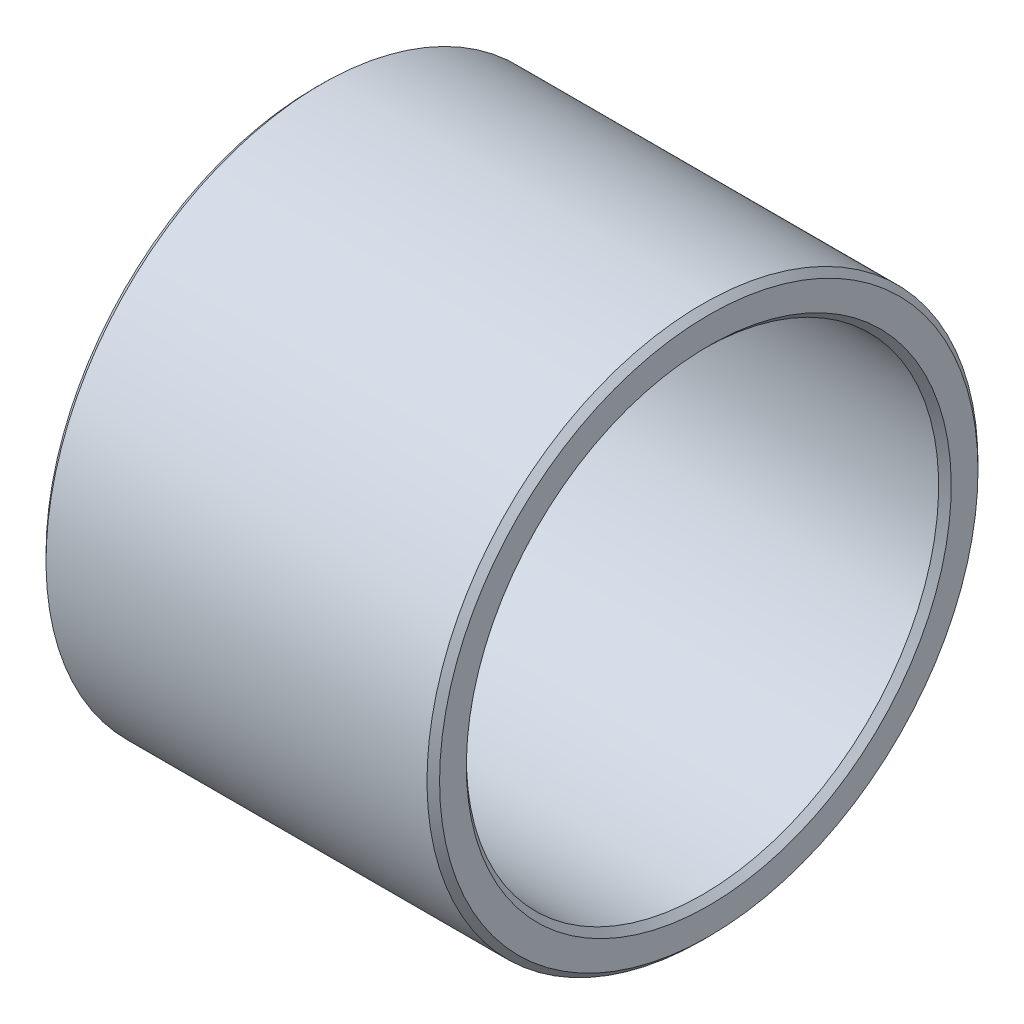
ISO-10303-21;
HEADER;
FILE_DESCRIPTION(('STEP AP214'),'2;1');
FILE_NAME('part.step','',(''),(''),'','','');
FILE_SCHEMA(('AUTOMOTIVE_DESIGN { 1 0 10303 214 1 1 1 1 }'));
ENDSEC;
DATA;
#1=APPLICATION_CONTEXT('core data for automotive mechanical design processes');
#2=APPLICATION_PROTOCOL_DEFINITION('international standard','automotive_design',2000,#1);
#3=PRODUCT_CONTEXT('',#1,'mechanical');
#4=PRODUCT('Part','Part','',(#3));
#5=PRODUCT_RELATED_PRODUCT_CATEGORY('part','',(#4));
#6=PRODUCT_DEFINITION_FORMATION('','',#4);
#7=PRODUCT_DEFINITION_CONTEXT('part definition',#1,'design');
#8=PRODUCT_DEFINITION('design','',#6,#7);
#9=PRODUCT_DEFINITION_SHAPE('','',#8);
#10=(LENGTH_UNIT() NAMED_UNIT(*) SI_UNIT(.MILLI.,.METRE.));
#11=(NAMED_UNIT(*) PLANE_ANGLE_UNIT() SI_UNIT($,.RADIAN.));
#12=(NAMED_UNIT(*) SI_UNIT($,.STERADIAN.) SOLID_ANGLE_UNIT());
#13=UNCERTAINTY_MEASURE_WITH_UNIT(LENGTH_MEASURE(1.E-05),#10,'distance_accuracy_value','');
#14=(GEOMETRIC_REPRESENTATION_CONTEXT(3) GLOBAL_UNCERTAINTY_ASSIGNED_CONTEXT((#13)) GLOBAL_UNIT_ASSIGNED_CONTEXT((#10,
#11,#12)) REPRESENTATION_CONTEXT('',''));
#15=CARTESIAN_POINT('',(0.,0.,0.));
#16=DIRECTION('',(0.,0.,1.));
#17=DIRECTION('',(1.,0.,0.));
#18=AXIS2_PLACEMENT_3D('',#15,#16,#17);
#19=CARTESIAN_POINT('',(0.,-16.25,0.));
#20=DIRECTION('',(-1.,0.,0.));
#21=DIRECTION('',(0.,1.,0.));
#22=AXIS2_PLACEMENT_3D('',#19,#20,#21);
#23=PLANE('',#22);
#24=CARTESIAN_POINT('',(0.,0.,0.));
#25=DIRECTION('',(1.,0.,0.));
#26=DIRECTION('',(0.,-1.,0.));
#27=AXIS2_PLACEMENT_3D('',#24,#25,#26);
#28=CIRCLE('',#27,15.4);
#29=CARTESIAN_POINT('',(0.,-15.4,0.));
#30=VERTEX_POINT('',#29);
#31=EDGE_CURVE('E9',#30,#30,#28,.T.);
#32=ORIENTED_EDGE('',*,*,#31,.T.);
#33=EDGE_LOOP('',(#32));
#34=FACE_BOUND('',#33,.T.);
#35=CARTESIAN_POINT('',(0.,0.,0.));
#36=DIRECTION('',(1.,0.,0.));
#37=DIRECTION('',(0.,-1.,0.));
#38=AXIS2_PLACEMENT_3D('',#35,#36,#37);
#39=CIRCLE('',#38,17.1);
#40=CARTESIAN_POINT('',(0.,-17.1,0.));
#41=VERTEX_POINT('',#40);
#42=EDGE_CURVE('E53',#41,#41,#39,.T.);
#43=ORIENTED_EDGE('',*,*,#42,.F.);
#44=EDGE_LOOP('',(#43));
#45=FACE_BOUND('',#44,.T.);
#46=ADVANCED_FACE('F15',(#34,#45),#23,.T.);
#47=CARTESIAN_POINT('',(0.2,0.,0.));
#48=DIRECTION('',(-1.,0.,0.));
#49=DIRECTION('',(0.,-1.,0.));
#50=AXIS2_PLACEMENT_3D('',#47,#48,#49);
#51=CONICAL_SURFACE('',#50,15.2,0.78539816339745);
#52=CARTESIAN_POINT('',(0.4,0.,0.));
#53=DIRECTION('',(1.,0.,0.));
#54=DIRECTION('',(0.,-1.,0.));
#55=AXIS2_PLACEMENT_3D('',#52,#53,#54);
#56=CIRCLE('',#55,15.);
#57=CARTESIAN_POINT('',(0.4,-15.,0.));
#58=VERTEX_POINT('',#57);
#59=EDGE_CURVE('E22',#58,#58,#56,.T.);
#60=ORIENTED_EDGE('',*,*,#59,.T.);
#61=EDGE_LOOP('',(#60));
#62=FACE_BOUND('',#61,.T.);
#63=ORIENTED_EDGE('',*,*,#31,.F.);
#64=EDGE_LOOP('',(#63));
#65=FACE_BOUND('',#64,.T.);
#66=ADVANCED_FACE('F82',(#62,#65),#51,.F.);
#67=CARTESIAN_POINT('',(12.5,0.,0.));
#68=DIRECTION('',(-1.,0.,0.));
#69=DIRECTION('',(0.,-1.,0.));
#70=AXIS2_PLACEMENT_3D('',#67,#68,#69);
#71=CYLINDRICAL_SURFACE('',#70,15.);
#72=CARTESIAN_POINT('',(24.6,0.,0.));
#73=DIRECTION('',(1.,0.,0.));
#74=DIRECTION('',(0.,-1.,0.));
#75=AXIS2_PLACEMENT_3D('',#72,#73,#74);
#76=CIRCLE('',#75,15.);
#77=CARTESIAN_POINT('',(24.6,-15.,0.));
#78=VERTEX_POINT('',#77);
#79=EDGE_CURVE('E58',#78,#78,#76,.T.);
#80=ORIENTED_EDGE('',*,*,#79,.T.);
#81=EDGE_LOOP('',(#80));
#82=FACE_BOUND('',#81,.T.);
#83=ORIENTED_EDGE('',*,*,#59,.F.);
#84=EDGE_LOOP('',(#83));
#85=FACE_BOUND('',#84,.T.);
#86=ADVANCED_FACE('F66',(#82,#85),#71,.F.);
#87=CARTESIAN_POINT('',(24.8,0.,0.));
#88=DIRECTION('',(1.,0.,0.));
#89=DIRECTION('',(0.,-1.,0.));
#90=AXIS2_PLACEMENT_3D('',#87,#88,#89);
#91=CONICAL_SURFACE('',#90,15.2,0.785398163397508);
#92=CARTESIAN_POINT('',(25.,0.,0.));
#93=DIRECTION('',(1.,0.,0.));
#94=DIRECTION('',(0.,-1.,0.));
#95=AXIS2_PLACEMENT_3D('',#92,#93,#94);
#96=CIRCLE('',#95,15.4);
#97=CARTESIAN_POINT('',(25.,-15.4,0.));
#98=VERTEX_POINT('',#97);
#99=EDGE_CURVE('E63',#98,#98,#96,.T.);
#100=ORIENTED_EDGE('',*,*,#99,.T.);
#101=EDGE_LOOP('',(#100));
#102=FACE_BOUND('',#101,.T.);
#103=ORIENTED_EDGE('',*,*,#79,.F.);
#104=EDGE_LOOP('',(#103));
#105=FACE_BOUND('',#104,.T.);
#106=ADVANCED_FACE('F69',(#102,#105),#91,.F.);
#107=CARTESIAN_POINT('',(25.,-16.25,0.));
#108=DIRECTION('',(1.,0.,0.));
#109=DIRECTION('',(0.,-1.,0.));
#110=AXIS2_PLACEMENT_3D('',#107,#108,#109);
#111=PLANE('',#110);
#112=CARTESIAN_POINT('',(25.,0.,0.));
#113=DIRECTION('',(1.,0.,0.));
#114=DIRECTION('',(0.,-1.,0.));
#115=AXIS2_PLACEMENT_3D('',#112,#113,#114);
#116=CIRCLE('',#115,17.1);
#117=CARTESIAN_POINT('',(25.,-17.1,0.));
#118=VERTEX_POINT('',#117);
#119=EDGE_CURVE('E61',#118,#118,#116,.T.);
#120=ORIENTED_EDGE('',*,*,#119,.T.);
#121=EDGE_LOOP('',(#120));
#122=FACE_BOUND('',#121,.T.);
#123=ORIENTED_EDGE('',*,*,#99,.F.);
#124=EDGE_LOOP('',(#123));
#125=FACE_BOUND('',#124,.T.);
#126=ADVANCED_FACE('F71',(#122,#125),#111,.T.);
#127=CARTESIAN_POINT('',(24.8,0.,0.));
#128=DIRECTION('',(-1.,0.,0.));
#129=DIRECTION('',(0.,-1.,0.));
#130=AXIS2_PLACEMENT_3D('',#127,#128,#129);
#131=CONICAL_SURFACE('',#130,17.3,0.785398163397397);
#132=CARTESIAN_POINT('',(24.6,0.,0.));
#133=DIRECTION('',(1.,0.,0.));
#134=DIRECTION('',(0.,-1.,0.));
#135=AXIS2_PLACEMENT_3D('',#132,#133,#134);
#136=CIRCLE('',#135,17.5);
#137=CARTESIAN_POINT('',(24.6,-17.5,0.));
#138=VERTEX_POINT('',#137);
#139=EDGE_CURVE('E55',#138,#138,#136,.T.);
#140=ORIENTED_EDGE('',*,*,#139,.T.);
#141=EDGE_LOOP('',(#140));
#142=FACE_BOUND('',#141,.T.);
#143=ORIENTED_EDGE('',*,*,#119,.F.);
#144=EDGE_LOOP('',(#143));
#145=FACE_BOUND('',#144,.T.);
#146=ADVANCED_FACE('F79',(#142,#145),#131,.T.);
#147=CARTESIAN_POINT('',(12.5,0.,0.));
#148=DIRECTION('',(-1.,0.,0.));
#149=DIRECTION('',(0.,-1.,0.));
#150=AXIS2_PLACEMENT_3D('',#147,#148,#149);
#151=CYLINDRICAL_SURFACE('',#150,17.5);
#152=CARTESIAN_POINT('',(0.4,0.,0.));
#153=DIRECTION('',(1.,0.,0.));
#154=DIRECTION('',(0.,-1.,0.));
#155=AXIS2_PLACEMENT_3D('',#152,#153,#154);
#156=CIRCLE('',#155,17.5);
#157=CARTESIAN_POINT('',(0.4,-17.5,0.));
#158=VERTEX_POINT('',#157);
#159=EDGE_CURVE('E49',#158,#158,#156,.T.);
#160=ORIENTED_EDGE('',*,*,#159,.T.);
#161=EDGE_LOOP('',(#160));
#162=FACE_BOUND('',#161,.T.);
#163=ORIENTED_EDGE('',*,*,#139,.F.);
#164=EDGE_LOOP('',(#163));
#165=FACE_BOUND('',#164,.T.);
#166=ADVANCED_FACE('F50',(#162,#165),#151,.T.);
#167=CARTESIAN_POINT('',(0.2,0.,0.));
#168=DIRECTION('',(1.,0.,0.));
#169=DIRECTION('',(0.,-1.,0.));
#170=AXIS2_PLACEMENT_3D('',#167,#168,#169);
#171=CONICAL_SURFACE('',#170,17.3,0.785398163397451);
#172=ORIENTED_EDGE('',*,*,#42,.T.);
#173=EDGE_LOOP('',(#172));
#174=FACE_BOUND('',#173,.T.);
#175=ORIENTED_EDGE('',*,*,#159,.F.);
#176=EDGE_LOOP('',(#175));
#177=FACE_BOUND('',#176,.T.);
#178=ADVANCED_FACE('F92',(#174,#177),#171,.T.);
#179=CLOSED_SHELL('',(#46,#66,#86,#106,#126,#146,#166,#178));
#180=MANIFOLD_SOLID_BREP('B1',#179);
#181=ADVANCED_BREP_SHAPE_REPRESENTATION('',(#18,#180),#14);
#182=SHAPE_DEFINITION_REPRESENTATION(#9,#181);
ENDSEC;
END-ISO-10303-21;
